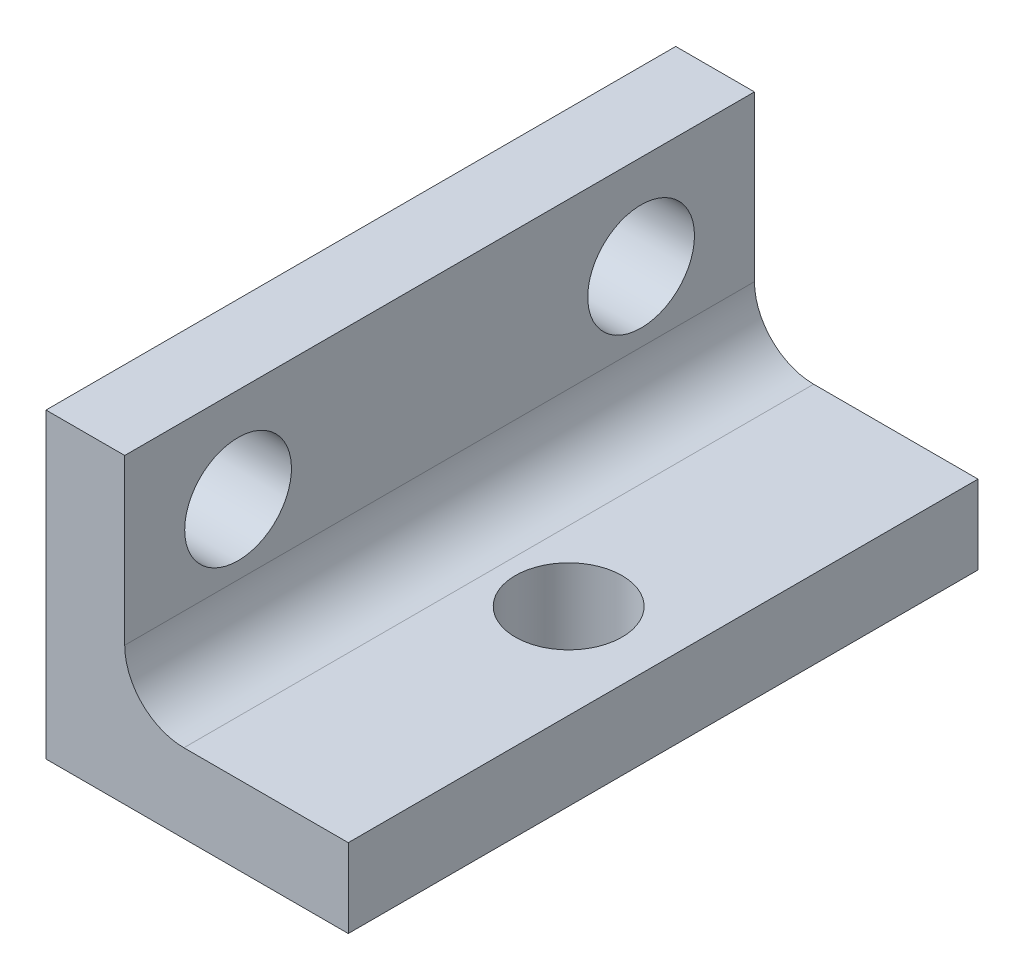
ISO-10303-21;
HEADER;
FILE_DESCRIPTION(('STEP AP214'),'2;1');
FILE_NAME('part.step','',(''),(''),'','','');
FILE_SCHEMA(('AUTOMOTIVE_DESIGN { 1 0 10303 214 1 1 1 1 }'));
ENDSEC;
DATA;
#1=APPLICATION_CONTEXT('core data for automotive mechanical design processes');
#2=APPLICATION_PROTOCOL_DEFINITION('international standard','automotive_design',2000,#1);
#3=PRODUCT_CONTEXT('',#1,'mechanical');
#4=PRODUCT('Part','Part','',(#3));
#5=PRODUCT_RELATED_PRODUCT_CATEGORY('part','',(#4));
#6=PRODUCT_DEFINITION_FORMATION('','',#4);
#7=PRODUCT_DEFINITION_CONTEXT('part definition',#1,'design');
#8=PRODUCT_DEFINITION('design','',#6,#7);
#9=PRODUCT_DEFINITION_SHAPE('','',#8);
#10=(LENGTH_UNIT() NAMED_UNIT(*) SI_UNIT(.MILLI.,.METRE.));
#11=(NAMED_UNIT(*) PLANE_ANGLE_UNIT() SI_UNIT($,.RADIAN.));
#12=(NAMED_UNIT(*) SI_UNIT($,.STERADIAN.) SOLID_ANGLE_UNIT());
#13=UNCERTAINTY_MEASURE_WITH_UNIT(LENGTH_MEASURE(1.E-05),#10,'distance_accuracy_value','');
#14=(GEOMETRIC_REPRESENTATION_CONTEXT(3) GLOBAL_UNCERTAINTY_ASSIGNED_CONTEXT((#13)) GLOBAL_UNIT_ASSIGNED_CONTEXT((#10,
#11,#12)) REPRESENTATION_CONTEXT('',''));
#15=CARTESIAN_POINT('',(0.,0.,0.));
#16=DIRECTION('',(0.,0.,1.));
#17=DIRECTION('',(1.,0.,0.));
#18=AXIS2_PLACEMENT_3D('',#15,#16,#17);
#19=CARTESIAN_POINT('',(0.,0.,12.7));
#20=DIRECTION('',(1.,0.,0.));
#21=DIRECTION('',(0.,0.,-1.));
#22=AXIS2_PLACEMENT_3D('',#19,#20,#21);
#23=PLANE('',#22);
#24=CARTESIAN_POINT('',(0.,8.38200000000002,8.128));
#25=DIRECTION('',(-1.,0.,0.));
#26=DIRECTION('',(0.,0.,1.));
#27=AXIS2_PLACEMENT_3D('',#24,#25,#26);
#28=CIRCLE('',#27,2.15264999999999);
#29=CARTESIAN_POINT('',(0.,8.38200000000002,10.28065));
#30=VERTEX_POINT('',#29);
#31=EDGE_CURVE('E134',#30,#30,#28,.T.);
#32=ORIENTED_EDGE('',*,*,#31,.F.);
#33=EDGE_LOOP('',(#32));
#34=FACE_BOUND('',#33,.T.);
#35=DIRECTION('',(0.,0.,-1.));
#36=VECTOR('',#35,1.);
#37=CARTESIAN_POINT('',(0.,12.192,12.7));
#38=LINE('',#37,#36);
#39=CARTESIAN_POINT('',(0.,12.192,12.7));
#40=VERTEX_POINT('',#39);
#41=CARTESIAN_POINT('',(0.,12.192,-12.7));
#42=VERTEX_POINT('',#41);
#43=EDGE_CURVE('E107',#40,#42,#38,.T.);
#44=ORIENTED_EDGE('',*,*,#43,.T.);
#45=DIRECTION('',(0.,-1.,0.));
#46=VECTOR('',#45,1.);
#47=CARTESIAN_POINT('',(0.,0.,-12.7));
#48=LINE('',#47,#46);
#49=CARTESIAN_POINT('',(0.,0.,-12.7));
#50=VERTEX_POINT('',#49);
#51=EDGE_CURVE('E101',#42,#50,#48,.T.);
#52=ORIENTED_EDGE('',*,*,#51,.T.);
#53=DIRECTION('',(0.,0.,-1.));
#54=VECTOR('',#53,1.);
#55=CARTESIAN_POINT('',(0.,0.,12.7));
#56=LINE('',#55,#54);
#57=CARTESIAN_POINT('',(0.,0.,12.7));
#58=VERTEX_POINT('',#57);
#59=EDGE_CURVE('E11',#58,#50,#56,.T.);
#60=ORIENTED_EDGE('',*,*,#59,.F.);
#61=DIRECTION('',(0.,-1.,0.));
#62=VECTOR('',#61,1.);
#63=CARTESIAN_POINT('',(0.,0.,12.7));
#64=LINE('',#63,#62);
#65=EDGE_CURVE('E137',#40,#58,#64,.T.);
#66=ORIENTED_EDGE('',*,*,#65,.F.);
#67=EDGE_LOOP('',(#44,#52,#60,#66));
#68=FACE_BOUND('',#67,.T.);
#69=CARTESIAN_POINT('',(0.,8.38200000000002,-8.128));
#70=DIRECTION('',(1.,0.,0.));
#71=DIRECTION('',(0.,0.,-1.));
#72=AXIS2_PLACEMENT_3D('',#69,#70,#71);
#73=CIRCLE('',#72,2.15264999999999);
#74=CARTESIAN_POINT('',(0.,8.38200000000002,-10.28065));
#75=VERTEX_POINT('',#74);
#76=EDGE_CURVE('E112',#75,#75,#73,.T.);
#77=ORIENTED_EDGE('',*,*,#76,.T.);
#78=EDGE_LOOP('',(#77));
#79=FACE_BOUND('',#78,.T.);
#80=ADVANCED_FACE('F30',(#34,#68,#79),#23,.F.);
#81=CARTESIAN_POINT('',(0.,0.,12.7));
#82=DIRECTION('',(0.,1.,0.));
#83=DIRECTION('',(0.,0.,1.));
#84=AXIS2_PLACEMENT_3D('',#81,#82,#83);
#85=PLANE('',#84);
#86=CARTESIAN_POINT('',(8.38200000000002,0.,0.));
#87=DIRECTION('',(0.,-1.,0.));
#88=DIRECTION('',(0.,0.,-1.));
#89=AXIS2_PLACEMENT_3D('',#86,#87,#88);
#90=CIRCLE('',#89,2.15264999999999);
#91=CARTESIAN_POINT('',(8.38200000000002,0.,-2.15264999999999));
#92=VERTEX_POINT('',#91);
#93=EDGE_CURVE('E127',#92,#92,#90,.T.);
#94=ORIENTED_EDGE('',*,*,#93,.F.);
#95=EDGE_LOOP('',(#94));
#96=FACE_BOUND('',#95,.T.);
#97=ORIENTED_EDGE('',*,*,#59,.T.);
#98=DIRECTION('',(1.,0.,0.));
#99=VECTOR('',#98,1.);
#100=CARTESIAN_POINT('',(0.,0.,-12.7));
#101=LINE('',#100,#99);
#102=CARTESIAN_POINT('',(12.192,0.,-12.7));
#103=VERTEX_POINT('',#102);
#104=EDGE_CURVE('E91',#50,#103,#101,.T.);
#105=ORIENTED_EDGE('',*,*,#104,.T.);
#106=DIRECTION('',(0.,0.,-1.));
#107=VECTOR('',#106,1.);
#108=CARTESIAN_POINT('',(12.192,0.,12.7));
#109=LINE('',#108,#107);
#110=CARTESIAN_POINT('',(12.192,0.,12.7));
#111=VERTEX_POINT('',#110);
#112=EDGE_CURVE('E38',#111,#103,#109,.T.);
#113=ORIENTED_EDGE('',*,*,#112,.F.);
#114=DIRECTION('',(1.,0.,0.));
#115=VECTOR('',#114,1.);
#116=CARTESIAN_POINT('',(0.,0.,12.7));
#117=LINE('',#116,#115);
#118=EDGE_CURVE('E92',#58,#111,#117,.T.);
#119=ORIENTED_EDGE('',*,*,#118,.F.);
#120=EDGE_LOOP('',(#97,#105,#113,#119));
#121=FACE_BOUND('',#120,.T.);
#122=ADVANCED_FACE('F89',(#96,#121),#85,.F.);
#123=CARTESIAN_POINT('',(12.192,0.,12.7));
#124=DIRECTION('',(-1.,0.,0.));
#125=DIRECTION('',(0.,-1.,0.));
#126=AXIS2_PLACEMENT_3D('',#123,#124,#125);
#127=PLANE('',#126);
#128=ORIENTED_EDGE('',*,*,#112,.T.);
#129=DIRECTION('',(0.,1.,0.));
#130=VECTOR('',#129,1.);
#131=CARTESIAN_POINT('',(12.192,0.,-12.7));
#132=LINE('',#131,#130);
#133=CARTESIAN_POINT('',(12.192,3.175,-12.7));
#134=VERTEX_POINT('',#133);
#135=EDGE_CURVE('E104',#103,#134,#132,.T.);
#136=ORIENTED_EDGE('',*,*,#135,.T.);
#137=DIRECTION('',(0.,0.,-1.));
#138=VECTOR('',#137,1.);
#139=CARTESIAN_POINT('',(12.192,3.175,12.7));
#140=LINE('',#139,#138);
#141=CARTESIAN_POINT('',(12.192,3.175,12.7));
#142=VERTEX_POINT('',#141);
#143=EDGE_CURVE('E155',#142,#134,#140,.T.);
#144=ORIENTED_EDGE('',*,*,#143,.F.);
#145=DIRECTION('',(0.,1.,0.));
#146=VECTOR('',#145,1.);
#147=CARTESIAN_POINT('',(12.192,0.,12.7));
#148=LINE('',#147,#146);
#149=EDGE_CURVE('E140',#111,#142,#148,.T.);
#150=ORIENTED_EDGE('',*,*,#149,.F.);
#151=EDGE_LOOP('',(#128,#136,#144,#150));
#152=FACE_BOUND('',#151,.T.);
#153=ADVANCED_FACE('F159',(#152),#127,.F.);
#154=CARTESIAN_POINT('',(5.5626,3.175,12.7));
#155=DIRECTION('',(0.,-1.,0.));
#156=DIRECTION('',(0.,0.,-1.));
#157=AXIS2_PLACEMENT_3D('',#154,#155,#156);
#158=PLANE('',#157);
#159=DIRECTION('',(-1.,0.,0.));
#160=VECTOR('',#159,1.);
#161=CARTESIAN_POINT('',(5.5626,3.175,-12.7));
#162=LINE('',#161,#160);
#163=CARTESIAN_POINT('',(5.5626,3.175,-12.7));
#164=VERTEX_POINT('',#163);
#165=EDGE_CURVE('E117',#134,#164,#162,.T.);
#166=ORIENTED_EDGE('',*,*,#165,.T.);
#167=DIRECTION('',(0.,0.,-1.));
#168=VECTOR('',#167,1.);
#169=CARTESIAN_POINT('',(5.5626,3.175,12.7));
#170=LINE('',#169,#168);
#171=CARTESIAN_POINT('',(5.5626,3.175,12.7));
#172=VERTEX_POINT('',#171);
#173=EDGE_CURVE('E153',#172,#164,#170,.T.);
#174=ORIENTED_EDGE('',*,*,#173,.F.);
#175=DIRECTION('',(-1.,0.,0.));
#176=VECTOR('',#175,1.);
#177=CARTESIAN_POINT('',(5.5626,3.175,12.7));
#178=LINE('',#177,#176);
#179=EDGE_CURVE('E142',#142,#172,#178,.T.);
#180=ORIENTED_EDGE('',*,*,#179,.F.);
#181=ORIENTED_EDGE('',*,*,#143,.T.);
#182=EDGE_LOOP('',(#166,#174,#180,#181));
#183=FACE_BOUND('',#182,.T.);
#184=CARTESIAN_POINT('',(8.38200000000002,3.175,0.));
#185=DIRECTION('',(0.,-1.,0.));
#186=DIRECTION('',(0.,0.,-1.));
#187=AXIS2_PLACEMENT_3D('',#184,#185,#186);
#188=CIRCLE('',#187,2.15264999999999);
#189=CARTESIAN_POINT('',(8.38200000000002,3.175,-2.15264999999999));
#190=VERTEX_POINT('',#189);
#191=EDGE_CURVE('E131',#190,#190,#188,.T.);
#192=ORIENTED_EDGE('',*,*,#191,.T.);
#193=EDGE_LOOP('',(#192));
#194=FACE_BOUND('',#193,.T.);
#195=ADVANCED_FACE('F167',(#183,#194),#158,.F.);
#196=CARTESIAN_POINT('',(5.5626,5.56260000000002,12.7));
#197=DIRECTION('',(0.,0.,-1.));
#198=DIRECTION('',(-1.,0.,0.));
#199=AXIS2_PLACEMENT_3D('',#196,#197,#198);
#200=CYLINDRICAL_SURFACE('',#199,2.3876);
#201=ORIENTED_EDGE('',*,*,#173,.T.);
#202=CARTESIAN_POINT('',(5.5626,5.5626,-12.7));
#203=DIRECTION('',(0.,0.,-1.));
#204=DIRECTION('',(1.,0.,0.));
#205=AXIS2_PLACEMENT_3D('',#202,#203,#204);
#206=CIRCLE('',#205,2.3876);
#207=CARTESIAN_POINT('',(3.175,5.5626,-12.7));
#208=VERTEX_POINT('',#207);
#209=EDGE_CURVE('E120',#164,#208,#206,.T.);
#210=ORIENTED_EDGE('',*,*,#209,.T.);
#211=DIRECTION('',(0.,0.,-1.));
#212=VECTOR('',#211,1.);
#213=CARTESIAN_POINT('',(3.175,5.56260000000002,12.7));
#214=LINE('',#213,#212);
#215=CARTESIAN_POINT('',(3.175,5.56260000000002,12.7));
#216=VERTEX_POINT('',#215);
#217=EDGE_CURVE('E151',#216,#208,#214,.T.);
#218=ORIENTED_EDGE('',*,*,#217,.F.);
#219=CARTESIAN_POINT('',(5.5626,5.56260000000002,12.7));
#220=DIRECTION('',(0.,0.,-1.));
#221=DIRECTION('',(1.,0.,0.));
#222=AXIS2_PLACEMENT_3D('',#219,#220,#221);
#223=CIRCLE('',#222,2.3876);
#224=EDGE_CURVE('E144',#172,#216,#223,.T.);
#225=ORIENTED_EDGE('',*,*,#224,.F.);
#226=EDGE_LOOP('',(#201,#210,#218,#225));
#227=FACE_BOUND('',#226,.T.);
#228=ADVANCED_FACE('F171',(#227),#200,.F.);
#229=CARTESIAN_POINT('',(3.175,12.192,12.7));
#230=DIRECTION('',(-1.,0.,0.));
#231=DIRECTION('',(0.,-1.,0.));
#232=AXIS2_PLACEMENT_3D('',#229,#230,#231);
#233=PLANE('',#232);
#234=CARTESIAN_POINT('',(3.17500000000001,8.38200000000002,8.128));
#235=DIRECTION('',(-1.,0.,0.));
#236=DIRECTION('',(0.,-1.,0.));
#237=AXIS2_PLACEMENT_3D('',#234,#235,#236);
#238=CIRCLE('',#237,2.15264999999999);
#239=CARTESIAN_POINT('',(3.17500000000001,6.22935000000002,8.128));
#240=VERTEX_POINT('',#239);
#241=EDGE_CURVE('E33',#240,#240,#238,.T.);
#242=ORIENTED_EDGE('',*,*,#241,.T.);
#243=EDGE_LOOP('',(#242));
#244=FACE_BOUND('',#243,.T.);
#245=ORIENTED_EDGE('',*,*,#217,.T.);
#246=DIRECTION('',(0.,1.,0.));
#247=VECTOR('',#246,1.);
#248=CARTESIAN_POINT('',(3.175,12.192,-12.7));
#249=LINE('',#248,#247);
#250=CARTESIAN_POINT('',(3.175,12.192,-12.7));
#251=VERTEX_POINT('',#250);
#252=EDGE_CURVE('E123',#208,#251,#249,.T.);
#253=ORIENTED_EDGE('',*,*,#252,.T.);
#254=DIRECTION('',(0.,0.,-1.));
#255=VECTOR('',#254,1.);
#256=CARTESIAN_POINT('',(3.175,12.192,12.7));
#257=LINE('',#256,#255);
#258=CARTESIAN_POINT('',(3.175,12.192,12.7));
#259=VERTEX_POINT('',#258);
#260=EDGE_CURVE('E149',#259,#251,#257,.T.);
#261=ORIENTED_EDGE('',*,*,#260,.F.);
#262=DIRECTION('',(0.,1.,0.));
#263=VECTOR('',#262,1.);
#264=CARTESIAN_POINT('',(3.175,12.192,12.7));
#265=LINE('',#264,#263);
#266=EDGE_CURVE('E50',#216,#259,#265,.T.);
#267=ORIENTED_EDGE('',*,*,#266,.F.);
#268=EDGE_LOOP('',(#245,#253,#261,#267));
#269=FACE_BOUND('',#268,.T.);
#270=CARTESIAN_POINT('',(3.175,8.38200000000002,-8.128));
#271=DIRECTION('',(1.,0.,0.));
#272=DIRECTION('',(0.,-1.,0.));
#273=AXIS2_PLACEMENT_3D('',#270,#271,#272);
#274=CIRCLE('',#273,2.15264999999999);
#275=CARTESIAN_POINT('',(3.175,6.22935000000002,-8.128));
#276=VERTEX_POINT('',#275);
#277=EDGE_CURVE('E109',#276,#276,#274,.T.);
#278=ORIENTED_EDGE('',*,*,#277,.F.);
#279=EDGE_LOOP('',(#278));
#280=FACE_BOUND('',#279,.T.);
#281=ADVANCED_FACE('F174',(#244,#269,#280),#233,.F.);
#282=CARTESIAN_POINT('',(0.,12.192,12.7));
#283=DIRECTION('',(0.,-1.,0.));
#284=DIRECTION('',(1.,0.,0.));
#285=AXIS2_PLACEMENT_3D('',#282,#283,#284);
#286=PLANE('',#285);
#287=ORIENTED_EDGE('',*,*,#260,.T.);
#288=DIRECTION('',(-1.,0.,0.));
#289=VECTOR('',#288,1.);
#290=CARTESIAN_POINT('',(0.,12.192,-12.7));
#291=LINE('',#290,#289);
#292=EDGE_CURVE('E126',#251,#42,#291,.T.);
#293=ORIENTED_EDGE('',*,*,#292,.T.);
#294=ORIENTED_EDGE('',*,*,#43,.F.);
#295=DIRECTION('',(-1.,0.,0.));
#296=VECTOR('',#295,1.);
#297=CARTESIAN_POINT('',(0.,12.192,12.7));
#298=LINE('',#297,#296);
#299=EDGE_CURVE('E45',#259,#40,#298,.T.);
#300=ORIENTED_EDGE('',*,*,#299,.F.);
#301=EDGE_LOOP('',(#287,#293,#294,#300));
#302=FACE_BOUND('',#301,.T.);
#303=ADVANCED_FACE('F177',(#302),#286,.F.);
#304=CARTESIAN_POINT('',(5.5626,5.56260000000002,12.7));
#305=DIRECTION('',(0.,0.,1.));
#306=DIRECTION('',(1.,0.,0.));
#307=AXIS2_PLACEMENT_3D('',#304,#305,#306);
#308=PLANE('',#307);
#309=ORIENTED_EDGE('',*,*,#65,.T.);
#310=ORIENTED_EDGE('',*,*,#118,.T.);
#311=ORIENTED_EDGE('',*,*,#149,.T.);
#312=ORIENTED_EDGE('',*,*,#179,.T.);
#313=ORIENTED_EDGE('',*,*,#224,.T.);
#314=ORIENTED_EDGE('',*,*,#266,.T.);
#315=ORIENTED_EDGE('',*,*,#299,.T.);
#316=EDGE_LOOP('',(#309,#310,#311,#312,#313,#314,#315));
#317=FACE_BOUND('',#316,.T.);
#318=ADVANCED_FACE('F162',(#317),#308,.T.);
#319=CARTESIAN_POINT('',(0.,8.38200000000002,8.128));
#320=DIRECTION('',(-1.,0.,0.));
#321=DIRECTION('',(0.,0.,1.));
#322=AXIS2_PLACEMENT_3D('',#319,#320,#321);
#323=CYLINDRICAL_SURFACE('',#322,2.15264999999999);
#324=ORIENTED_EDGE('',*,*,#31,.T.);
#325=EDGE_LOOP('',(#324));
#326=FACE_BOUND('',#325,.T.);
#327=ORIENTED_EDGE('',*,*,#241,.F.);
#328=EDGE_LOOP('',(#327));
#329=FACE_BOUND('',#328,.T.);
#330=ADVANCED_FACE('F184',(#326,#329),#323,.F.);
#331=CARTESIAN_POINT('',(8.38200000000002,0.,0.));
#332=DIRECTION('',(0.,-1.,0.));
#333=DIRECTION('',(0.,0.,-1.));
#334=AXIS2_PLACEMENT_3D('',#331,#332,#333);
#335=CYLINDRICAL_SURFACE('',#334,2.15264999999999);
#336=ORIENTED_EDGE('',*,*,#93,.T.);
#337=EDGE_LOOP('',(#336));
#338=FACE_BOUND('',#337,.T.);
#339=ORIENTED_EDGE('',*,*,#191,.F.);
#340=EDGE_LOOP('',(#339));
#341=FACE_BOUND('',#340,.T.);
#342=ADVANCED_FACE('F198',(#338,#341),#335,.F.);
#343=CARTESIAN_POINT('',(5.5626,5.5626,-12.7));
#344=DIRECTION('',(0.,0.,-1.));
#345=DIRECTION('',(1.,0.,0.));
#346=AXIS2_PLACEMENT_3D('',#343,#344,#345);
#347=PLANE('',#346);
#348=ORIENTED_EDGE('',*,*,#51,.F.);
#349=ORIENTED_EDGE('',*,*,#292,.F.);
#350=ORIENTED_EDGE('',*,*,#252,.F.);
#351=ORIENTED_EDGE('',*,*,#209,.F.);
#352=ORIENTED_EDGE('',*,*,#165,.F.);
#353=ORIENTED_EDGE('',*,*,#135,.F.);
#354=ORIENTED_EDGE('',*,*,#104,.F.);
#355=EDGE_LOOP('',(#348,#349,#350,#351,#352,#353,#354));
#356=FACE_BOUND('',#355,.T.);
#357=ADVANCED_FACE('F99',(#356),#347,.T.);
#358=CARTESIAN_POINT('',(0.,8.38200000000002,-8.128));
#359=DIRECTION('',(-1.,0.,0.));
#360=DIRECTION('',(0.,0.,-1.));
#361=AXIS2_PLACEMENT_3D('',#358,#359,#360);
#362=CYLINDRICAL_SURFACE('',#361,2.15264999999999);
#363=ORIENTED_EDGE('',*,*,#76,.F.);
#364=EDGE_LOOP('',(#363));
#365=FACE_BOUND('',#364,.T.);
#366=ORIENTED_EDGE('',*,*,#277,.T.);
#367=EDGE_LOOP('',(#366));
#368=FACE_BOUND('',#367,.T.);
#369=ADVANCED_FACE('F210',(#365,#368),#362,.F.);
#370=CLOSED_SHELL('',(#80,#122,#153,#195,#228,#281,#303,#318,#330,#342,#357,#369));
#371=MANIFOLD_SOLID_BREP('B2',#370);
#372=ADVANCED_BREP_SHAPE_REPRESENTATION('',(#18,#371),#14);
#373=SHAPE_DEFINITION_REPRESENTATION(#9,#372);
ENDSEC;
END-ISO-10303-21;
